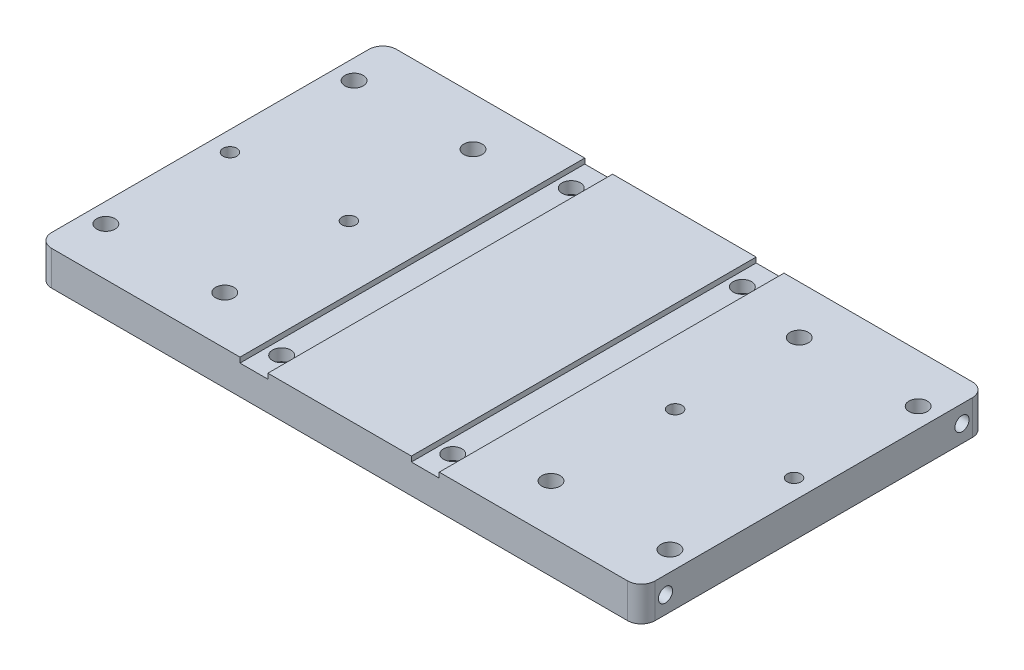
from build123d import *

# Parameters (mm, degrees)
SKETCH1_W                                         = 277.876
SKETCH1_H                                         = 158.75
BOSS_EXTRUDE1_DEPTH                               = 7.9375
SKETCH2_W                                         = 12.827
SKETCH2_H                                         = 2.38600742
CUT_EXTRUDE1_DEPTH                                = 212.112136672
CBORE_FOR_5_16_SOCKET_HEAD_CAP_SCREW1_D           = 8.4328
CBORE_FOR_5_16_SOCKET_HEAD_CAP_SCREW1_CBORE_D     = 13.49502
CBORE_FOR_5_16_SOCKET_HEAD_CAP_SCREW1_CBORE_DEPTH = 7.9375
F_5_16_18_TAPPED_HOLE1_AT_2_COUNT                 = 2
F_5_16_18_TAPPED_HOLE1_AT_2_PITCH                 = 136.525
CBORE_FOR_5_16_SOCKET_HEAD_CAP_SCREW2_D           = 8.4328
CBORE_FOR_5_16_SOCKET_HEAD_CAP_SCREW2_CBORE_D     = 13.49502
CBORE_FOR_5_16_SOCKET_HEAD_CAP_SCREW2_CBORE_DEPTH = 7.9375
F_1_4_0_2500_DOWEL_HOLE1_D                        = 6.35
FILLET1_R                                         = 6.35


with BuildPart() as part:
    # Sketch1 → Boss-Extrude1 (new, symmetric)
    with BuildSketch(Plane(origin=(0, 0, 0), x_dir=(1, 0, 0), z_dir=(0, 1, 0))):
        Rectangle(SKETCH1_W, SKETCH1_H)
    extrude(amount=BOSS_EXTRUDE1_DEPTH, both=True)

    # Sketch2 → Cut-Extrude1 (cut, through all)
    with BuildSketch(Plane(origin=(0, 0, -79.375), x_dir=(-1, 0, 0), z_dir=(0, 0, -1))):
        with Locations((-39.4589, 6.74449629)):
            Rectangle(SKETCH2_W, SKETCH2_H)
        with Locations((39.4589, 6.74449629)):
            Rectangle(SKETCH2_W, SKETCH2_H)
    extrude(amount=-CUT_EXTRUDE1_DEPTH, mode=Mode.SUBTRACT)

    # CBORE for 5_16 Socket Head Cap Screw1 (through all)
    with Locations(Plane(origin=(0, -7.9375, 0), x_dir=(-1, 0, 0), z_dir=(0, -1, 0))):
        with Locations((39.3954, 66.675), (39.3954, -66.675), (-39.3954, -66.675), (-39.3954, 66.675)):
            CounterBoreHole(CBORE_FOR_5_16_SOCKET_HEAD_CAP_SCREW1_D / 2, CBORE_FOR_5_16_SOCKET_HEAD_CAP_SCREW1_CBORE_D / 2, CBORE_FOR_5_16_SOCKET_HEAD_CAP_SCREW1_CBORE_DEPTH)

    # Sketch6 → 5_16-18 Tapped Hole1 (revolve, cut)
    with BuildSketch(Plane(origin=(138.938, 0, 68.2625), x_dir=(0, 0, -1), z_dir=(0, 1, 0))):
        Polygon((0, 0), (0, 22.281148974), (3.2639, 20.32), (3.2639, 0), align=None)
    f_5_16_18_tapped_hole1 = revolve(axis=Axis((145.288, 0, 68.2625), (-1, 0, 0)), mode=Mode.SUBTRACT)

    # 5_16-18 Tapped Hole1 at 2: 5_16-18 Tapped Hole1 ×2
    with Locations(*[(0, 0, -i * F_5_16_18_TAPPED_HOLE1_AT_2_PITCH) for i in range(1, F_5_16_18_TAPPED_HOLE1_AT_2_COUNT)]):
        add(f_5_16_18_tapped_hole1, mode=Mode.SUBTRACT)

    # CBORE for 5_16 Socket Head Cap Screw2 (through all)
    with Locations(Plane(origin=(0, -7.9375, 0), x_dir=(-1, 0, 0), z_dir=(0, -1, 0))):
        with Locations((75.1078, 57.15), (75.1078, -57.15), (129.8702, -57.15), (129.8702, 57.15), (-129.8702, -57.15), (-129.8702, 57.15), (-75.1078, -57.15), (-75.1078, 57.15)):
            CounterBoreHole(CBORE_FOR_5_16_SOCKET_HEAD_CAP_SCREW2_D / 2, CBORE_FOR_5_16_SOCKET_HEAD_CAP_SCREW2_CBORE_D / 2, CBORE_FOR_5_16_SOCKET_HEAD_CAP_SCREW2_CBORE_DEPTH)

    # 1_4 _0.2500_ Dowel Hole1 (through all)
    with Locations(Plane(origin=(0, 7.9375, 0), x_dir=(1, 0, 0), z_dir=(0, 1, 0))):
        with Locations((129.8702, 0), (75.1078, 0), (-129.8702, 0), (-75.1078, 0)):
            Hole(F_1_4_0_2500_DOWEL_HOLE1_D / 2)

    # Mirror1: 5_16-18 Tapped Hole1 across plane
    add(f_5_16_18_tapped_hole1.mirror(Plane(origin=(0, 0, 0), x_dir=(0, 0, 1), z_dir=(1, 0, 0))), mode=Mode.SUBTRACT)

    # Mirror1 copy 1 sketch → Mirror1 copy 1 (revolve, cut)
    with BuildSketch(Plane(origin=(-138.938, 0, -68.2625), x_dir=(0, 0, -1), z_dir=(0, 1, 0))):
        Polygon((0, 0), (0, -22.281148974), (3.2639, -20.32), (3.2639, 0), align=None)
    revolve(axis=Axis((-145.288, 0, -68.2625), (-1, 0, 0)), mode=Mode.SUBTRACT)

    # Fillet1
    fillet1_edges = [part.edges().sort_by_distance(p)[0] for p in [
        (138.938, 0, 79.375),
        (-138.938, 0, 79.375),
        (-138.938, 0, -79.375),
        (138.938, 0, -79.375),
    ]]
    fillet(fillet1_edges, radius=FILLET1_R)


solid = part.part
